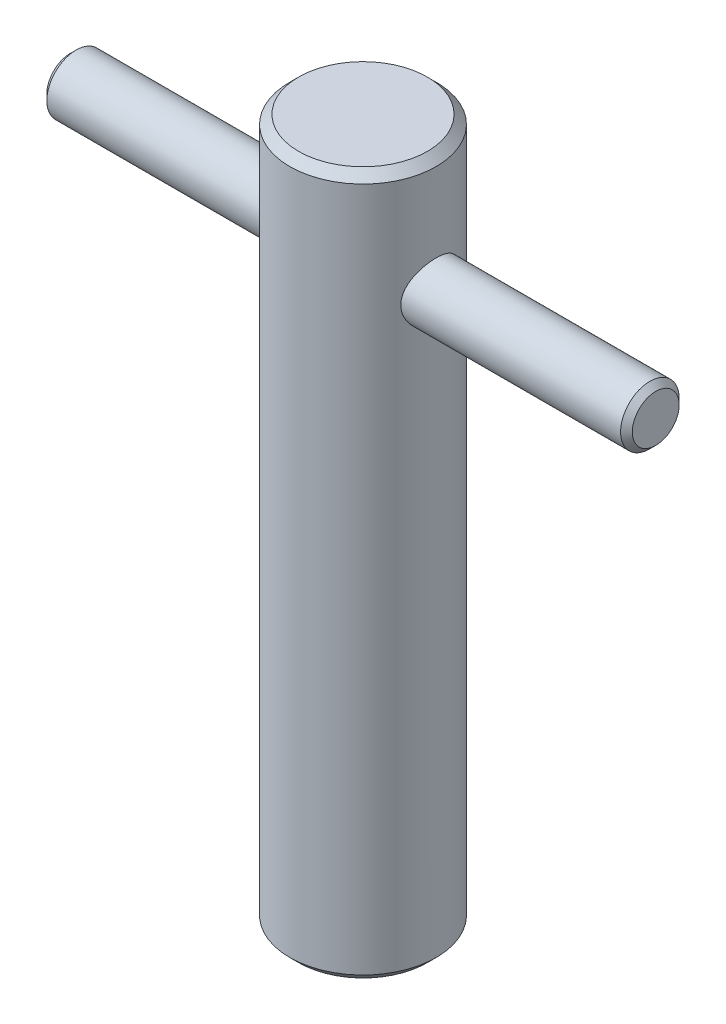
from build123d import *

# Parameters (mm, degrees)
SKETCH_1_R          = 12.5
EXTRUDE_1_DEPTH     = 120
CHAMFER_1_SIZE      = 1.5
SKETCH_2_W          = 10
SKETCH_2_H          = 10
CUT_EXTRUDE_1_DEPTH = 30
SKETCH_3_R          = 5
CUT_EXTRUDE_2_DEPTH = 15
SKETCH_4_R          = 5
EXTRUDE_2_DEPTH     = 50
CHAMFER_2_SIZE      = 1


with BuildPart() as part:
    # Sketch 1 → Extrude 1 (new body)
    with BuildSketch(Plane(origin=(0, 0, 0), x_dir=(1, 0, 0), z_dir=(0, 1, 0))):
        with Locations(Location((0, 0, 0), (0, 0, 270))):
            Circle(SKETCH_1_R)
    extrude(amount=EXTRUDE_1_DEPTH)

    # Chamfer 1
    chamfer_1_edges = [part.edges().sort_by_distance(p)[0] for p in [
        (0, 0, -12.5),
        (0, 120, -12.5),
    ]]
    chamfer(chamfer_1_edges, length=CHAMFER_1_SIZE)

    # Sketch 2 → Cut-Extrude 1 (cut)
    with BuildSketch(Plane.XZ):
        Rectangle(SKETCH_2_W, SKETCH_2_H)
    extrude(amount=-CUT_EXTRUDE_1_DEPTH, mode=Mode.SUBTRACT)

    # Sketch 3 → Cut-Extrude 2 (cut, symmetric)
    with BuildSketch(Plane(origin=(0, 0, 0), x_dir=(0, 0, -1), z_dir=(1, 0, 0))):
        with Locations((0, 100)):
            Circle(SKETCH_3_R)
    extrude(amount=CUT_EXTRUDE_2_DEPTH, both=True, mode=Mode.SUBTRACT)


with BuildPart() as body_2:
    # Sketch 4 → Extrude 2 (new, symmetric)
    with BuildSketch(Plane(origin=(0, 0, 0), x_dir=(0, 0, -1), z_dir=(1, 0, 0))):
        with Locations((0, 100)):
            Circle(SKETCH_4_R)
    extrude(amount=EXTRUDE_2_DEPTH, both=True)

    # Chamfer 2
    chamfer_2_edges = [body_2.edges().sort_by_distance(p)[0] for p in [
        (-50, 100, 5),
        (50, 100, 5),
    ]]
    chamfer(chamfer_2_edges, length=CHAMFER_2_SIZE)


solid = Compound([part.part, body_2.part])
